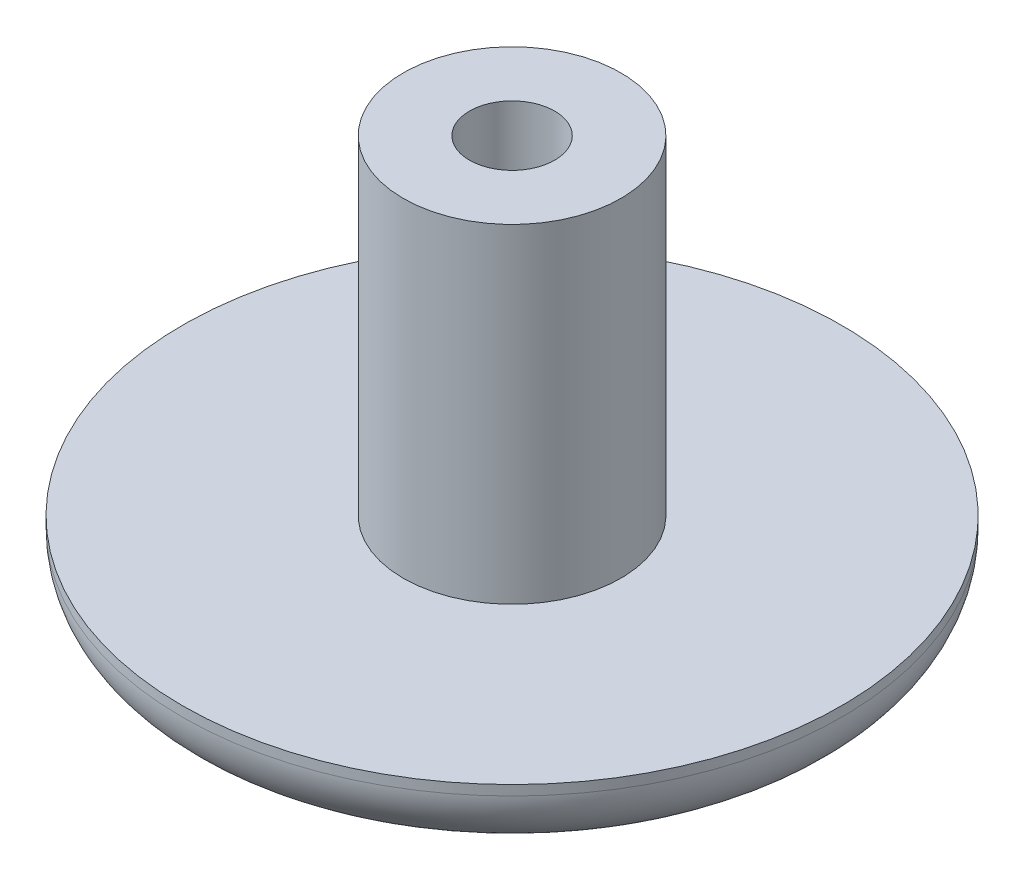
from build123d import *

# Parameters (mm, degrees)
ESQUISSE2_R             = 0.685
ENL_V_MAT_EXTRU_1_DEPTH = 5


with BuildPart() as part:
    # Esquisse1 → R_volution1 (revolve)
    with BuildSketch(Plane.XY, mode=Mode.PRIVATE) as r_volution1_sk:
        with BuildLine():
            Line((0, 0), (4.3, 0))
            ThreePointArc((4.3, 0), (5.007106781, 0.292893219), (5.3, 1))
            Line((5.3, 1), (5.3, 1.16))
            Line((5.3, 1.16), (1.75, 1.16))
            Line((1.75, 1.16), (1.75, 6.45))
            Line((1.75, 6.45), (0, 6.45))
            Line((0, 6.45), (0, 0))
        make_face()
    revolve(r_volution1_sk.sketch.rotate(Axis((0, 6.45, 0), (0, -1, 0)), 90), axis=Axis((0, 6.45, 0), (0, -1, 0)))

    # Esquisse2 → Enl_v. mat.-Extru.1 (cut)
    with BuildSketch(Plane(origin=(0, 6.45, 0), x_dir=(-1, 0, 0), z_dir=(0, 1, 0))):
        with Locations(Location((0, 0, 0), (0, 0, 90))):
            Circle(ESQUISSE2_R)
    extrude(amount=-ENL_V_MAT_EXTRU_1_DEPTH, mode=Mode.SUBTRACT)


solid = part.part
